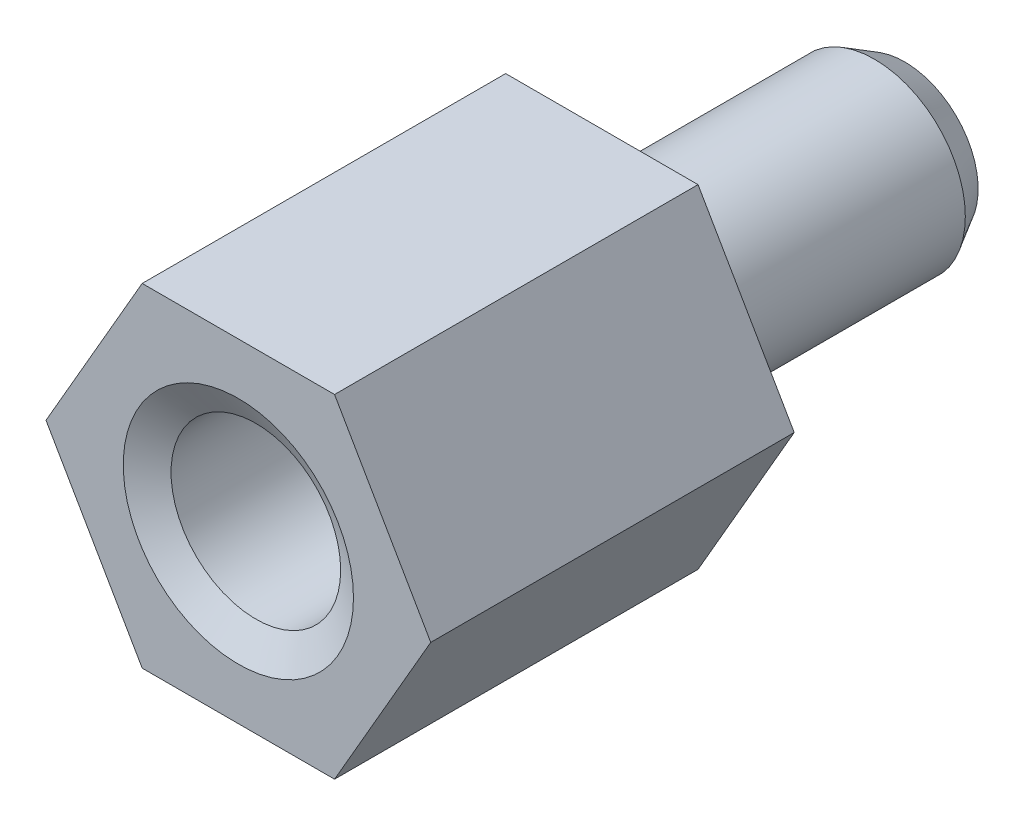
from build123d import *

# Parameters (mm, degrees)
BOSS_EXTRUDE1_DEPTH = 6
SKETCH2_R           = 1.5
BOSS_EXTRUDE2_DEPTH = 5
CHAMFER1_SIZE       = 0.5
CHAMFER1_SIZE2      = 0.288675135
SKETCH3_R           = 1.4
CUT_EXTRUDE1_DEPTH  = 3.5
CHAMFER2_SIZE       = 1.2
CHAMFER2_SIZE2      = 0.692820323
CHAMFER3_SIZE       = 0.5
CHAMFER3_SIZE2      = 0.288675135


with BuildPart() as part:
    # Sketch1 → Boss-Extrude1 (new body)
    with BuildSketch(Plane.XY):
        Polygon((1.58771324, 2.75), (-1.58771324, 2.75), (-3.175426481, 0), (-1.58771324, -2.75), (1.58771324, -2.75), (3.175426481, 0), align=None)
    extrude(amount=BOSS_EXTRUDE1_DEPTH)

    # Sketch2 → Boss-Extrude2 (add)
    with BuildSketch(Plane(origin=(0, 0, 0), x_dir=(-1, 0, 0), z_dir=(0, 0, -1))):
        Circle(SKETCH2_R)
    extrude(amount=BOSS_EXTRUDE2_DEPTH)

    # Chamfer1
    chamfer1_edges = [part.edges().sort_by_distance(p)[0] for p in [
        (1.5, 0, -5),
    ]]
    chamfer1_side = [part.faces().sort_by_distance(p)[0] for p in [
        (1.5, 0, -2.5),
    ]]
    chamfer(chamfer1_edges, length=CHAMFER1_SIZE, length2=CHAMFER1_SIZE2, reference=chamfer1_side[0])

    # Sketch3 → Cut-Extrude1 (cut)
    with BuildSketch(Plane.XY.offset(6)):
        Circle(SKETCH3_R)
    extrude(amount=-CUT_EXTRUDE1_DEPTH, mode=Mode.SUBTRACT)

    # Chamfer2
    chamfer2_edges = [part.edges().sort_by_distance(p)[0] for p in [
        (-1.4, 0, 2.5),
    ]]
    chamfer2_side = [part.faces().sort_by_distance(p)[0] for p in [
        (0, 0, 2.5),
    ]]
    chamfer(chamfer2_edges, length=CHAMFER2_SIZE, length2=CHAMFER2_SIZE2, reference=chamfer2_side[0])

    # Chamfer3
    chamfer3_edges = [part.edges().sort_by_distance(p)[0] for p in [
        (-1.4, 0, 6),
    ]]
    chamfer3_side = [part.faces().sort_by_distance(p)[0] for p in [
        (0, 2.665986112, 6),
    ]]
    chamfer(chamfer3_edges, length=CHAMFER3_SIZE, length2=CHAMFER3_SIZE2, reference=chamfer3_side[0])


solid = part.part
